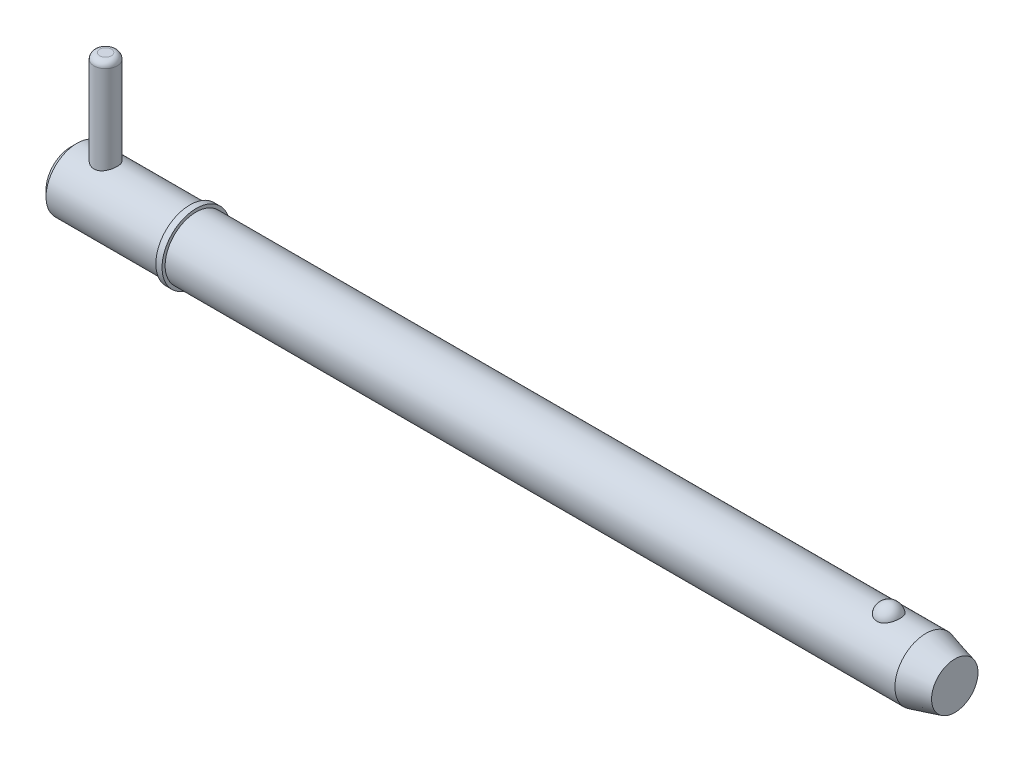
ISO-10303-21;
HEADER;
FILE_DESCRIPTION(('STEP AP214'),'2;1');
FILE_NAME('part.step','',(''),(''),'','','');
FILE_SCHEMA(('AUTOMOTIVE_DESIGN { 1 0 10303 214 1 1 1 1 }'));
ENDSEC;
DATA;
#1=APPLICATION_CONTEXT('core data for automotive mechanical design processes');
#2=APPLICATION_PROTOCOL_DEFINITION('international standard','automotive_design',2000,#1);
#3=PRODUCT_CONTEXT('',#1,'mechanical');
#4=PRODUCT('Part','Part','',(#3));
#5=PRODUCT_RELATED_PRODUCT_CATEGORY('part','',(#4));
#6=PRODUCT_DEFINITION_FORMATION('','',#4);
#7=PRODUCT_DEFINITION_CONTEXT('part definition',#1,'design');
#8=PRODUCT_DEFINITION('design','',#6,#7);
#9=PRODUCT_DEFINITION_SHAPE('','',#8);
#10=(LENGTH_UNIT() NAMED_UNIT(*) SI_UNIT(.MILLI.,.METRE.));
#11=(NAMED_UNIT(*) PLANE_ANGLE_UNIT() SI_UNIT($,.RADIAN.));
#12=(NAMED_UNIT(*) SI_UNIT($,.STERADIAN.) SOLID_ANGLE_UNIT());
#13=UNCERTAINTY_MEASURE_WITH_UNIT(LENGTH_MEASURE(1.E-05),#10,'distance_accuracy_value','');
#14=(GEOMETRIC_REPRESENTATION_CONTEXT(3) GLOBAL_UNCERTAINTY_ASSIGNED_CONTEXT((#13)) GLOBAL_UNIT_ASSIGNED_CONTEXT((#10,
#11,#12)) REPRESENTATION_CONTEXT('',''));
#15=CARTESIAN_POINT('',(0.,0.,0.));
#16=DIRECTION('',(0.,0.,1.));
#17=DIRECTION('',(1.,0.,0.));
#18=AXIS2_PLACEMENT_3D('',#15,#16,#17);
#19=CARTESIAN_POINT('',(7.14,25.4,0.));
#20=DIRECTION('',(0.,-1.,0.));
#21=DIRECTION('',(0.,0.,-1.));
#22=AXIS2_PLACEMENT_3D('',#19,#20,#21);
#23=CYLINDRICAL_SURFACE('',#22,2.38);
#24=CARTESIAN_POINT('',(7.14,-5.16,0.));
#25=DIRECTION('',(0.,1.,0.));
#26=DIRECTION('',(0.,0.,1.));
#27=AXIS2_PLACEMENT_3D('',#24,#25,#26);
#28=CIRCLE('',#27,2.38);
#29=CARTESIAN_POINT('',(7.14,-5.16,2.38));
#30=VERTEX_POINT('',#29);
#31=EDGE_CURVE('P0_E25',#30,#30,#28,.T.);
#32=ORIENTED_EDGE('',*,*,#31,.T.);
#33=EDGE_LOOP('',(#32));
#34=FACE_BOUND('',#33,.T.);
#35=CARTESIAN_POINT('',(7.14,24.21,0.));
#36=DIRECTION('',(0.,1.,0.));
#37=DIRECTION('',(0.,0.,1.));
#38=AXIS2_PLACEMENT_3D('',#35,#36,#37);
#39=CIRCLE('',#38,2.38);
#40=CARTESIAN_POINT('',(7.14,24.21,2.38));
#41=VERTEX_POINT('',#40);
#42=EDGE_CURVE('P0_E29',#41,#41,#39,.F.);
#43=ORIENTED_EDGE('',*,*,#42,.T.);
#44=EDGE_LOOP('',(#43));
#45=FACE_BOUND('',#44,.T.);
#46=ADVANCED_FACE('P0_F14',(#34,#45),#23,.T.);
#47=CARTESIAN_POINT('',(7.14,25.4,0.));
#48=DIRECTION('',(0.,1.,0.));
#49=DIRECTION('',(0.,0.,1.));
#50=AXIS2_PLACEMENT_3D('',#47,#48,#49);
#51=PLANE('',#50);
#52=CARTESIAN_POINT('',(7.14,25.4,0.));
#53=DIRECTION('',(0.,1.,0.));
#54=DIRECTION('',(0.,0.,1.));
#55=AXIS2_PLACEMENT_3D('',#52,#53,#54);
#56=CIRCLE('',#55,1.19);
#57=CARTESIAN_POINT('',(7.14,25.4,1.19));
#58=VERTEX_POINT('',#57);
#59=EDGE_CURVE('P0_E10',#58,#58,#56,.T.);
#60=ORIENTED_EDGE('',*,*,#59,.T.);
#61=EDGE_LOOP('',(#60));
#62=FACE_BOUND('',#61,.T.);
#63=ADVANCED_FACE('P0_F46',(#62),#51,.T.);
#64=CARTESIAN_POINT('',(7.14,-6.35,0.));
#65=DIRECTION('',(0.,1.,0.));
#66=DIRECTION('',(0.,0.,1.));
#67=AXIS2_PLACEMENT_3D('',#64,#65,#66);
#68=PLANE('',#67);
#69=CARTESIAN_POINT('',(7.14,-6.35,0.));
#70=DIRECTION('',(0.,1.,0.));
#71=DIRECTION('',(0.,0.,1.));
#72=AXIS2_PLACEMENT_3D('',#69,#70,#71);
#73=CIRCLE('',#72,1.19);
#74=CARTESIAN_POINT('',(7.14,-6.35,1.19));
#75=VERTEX_POINT('',#74);
#76=EDGE_CURVE('P0_E21',#75,#75,#73,.F.);
#77=ORIENTED_EDGE('',*,*,#76,.T.);
#78=EDGE_LOOP('',(#77));
#79=FACE_BOUND('',#78,.T.);
#80=ADVANCED_FACE('P0_F43',(#79),#68,.F.);
#81=CARTESIAN_POINT('',(7.14,-5.16,0.));
#82=DIRECTION('',(0.,1.,0.));
#83=DIRECTION('',(0.,0.,1.));
#84=AXIS2_PLACEMENT_3D('',#81,#82,#83);
#85=DEGENERATE_TOROIDAL_SURFACE('',#84,1.19,1.19,.T.);
#86=ORIENTED_EDGE('',*,*,#76,.F.);
#87=EDGE_LOOP('',(#86));
#88=FACE_BOUND('',#87,.T.);
#89=ORIENTED_EDGE('',*,*,#31,.F.);
#90=EDGE_LOOP('',(#89));
#91=FACE_BOUND('',#90,.T.);
#92=ADVANCED_FACE('P0_F38',(#88,#91),#85,.T.);
#93=CARTESIAN_POINT('',(7.14,24.21,0.));
#94=DIRECTION('',(0.,1.,0.));
#95=DIRECTION('',(0.,0.,1.));
#96=AXIS2_PLACEMENT_3D('',#93,#94,#95);
#97=DEGENERATE_TOROIDAL_SURFACE('',#96,1.19,1.19,.T.);
#98=ORIENTED_EDGE('',*,*,#42,.F.);
#99=EDGE_LOOP('',(#98));
#100=FACE_BOUND('',#99,.T.);
#101=ORIENTED_EDGE('',*,*,#59,.F.);
#102=EDGE_LOOP('',(#101));
#103=FACE_BOUND('',#102,.T.);
#104=ADVANCED_FACE('P0_F16',(#100,#103),#97,.T.);
#105=CLOSED_SHELL('',(#46,#63,#80,#92,#104));
#106=MANIFOLD_SOLID_BREP('P0_B1',#105);
#107=CARTESIAN_POINT('',(0.,0.,0.));
#108=DIRECTION('',(1.,0.,0.));
#109=DIRECTION('',(0.,0.,-1.));
#110=AXIS2_PLACEMENT_3D('',#107,#108,#109);
#111=CYLINDRICAL_SURFACE('',#110,6.35);
#112=CARTESIAN_POINT('',(175.355369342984,0.,0.));
#113=DIRECTION('',(1.,0.,0.));
#114=DIRECTION('',(0.,0.,-1.));
#115=AXIS2_PLACEMENT_3D('',#112,#113,#114);
#116=CIRCLE('',#115,6.35);
#117=CARTESIAN_POINT('',(175.355369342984,0.,-6.35));
#118=VERTEX_POINT('',#117);
#119=EDGE_CURVE('P1_E81',#118,#118,#116,.T.);
#120=ORIENTED_EDGE('',*,*,#119,.F.);
#121=EDGE_LOOP('',(#120));
#122=FACE_BOUND('',#121,.T.);
#123=CARTESIAN_POINT('',(25.7,0.,0.));
#124=DIRECTION('',(1.,0.,0.));
#125=DIRECTION('',(0.,0.,-1.));
#126=AXIS2_PLACEMENT_3D('',#123,#124,#125);
#127=CIRCLE('',#126,6.35);
#128=CARTESIAN_POINT('',(25.7,0.,-6.35));
#129=VERTEX_POINT('',#128);
#130=EDGE_CURVE('P1_E85',#129,#129,#127,.T.);
#131=ORIENTED_EDGE('',*,*,#130,.T.);
#132=EDGE_LOOP('',(#131));
#133=FACE_BOUND('',#132,.T.);
#134=CARTESIAN_POINT('',(167.730021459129,5.87502187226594,2.40969251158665));
#135=CARTESIAN_POINT('',(167.605030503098,5.87501645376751,2.40969773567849));
#136=CARTESIAN_POINT('',(167.480080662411,5.87916061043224,2.39967292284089));
#137=CARTESIAN_POINT('',(167.233909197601,5.89523112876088,2.35991730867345));
#138=CARTESIAN_POINT('',(167.112686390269,5.90715499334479,2.33019283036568));
#139=CARTESIAN_POINT('',(166.877517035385,5.93739567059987,2.25201402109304));
#140=CARTESIAN_POINT('',(166.763560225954,5.95570321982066,2.20358681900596));
#141=CARTESIAN_POINT('',(166.54557352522,5.99672067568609,2.08937987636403));
#142=CARTESIAN_POINT('',(166.441545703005,6.0194314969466,2.02359652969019));
#143=CARTESIAN_POINT('',(166.242943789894,6.06760647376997,1.87428969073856));
#144=CARTESIAN_POINT('',(166.148726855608,6.09313095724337,1.79031110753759));
#145=CARTESIAN_POINT('',(165.975255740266,6.14375873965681,1.6080017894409));
#146=CARTESIAN_POINT('',(165.896004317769,6.16886196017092,1.50966841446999));
#147=CARTESIAN_POINT('',(165.750845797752,6.21724600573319,1.29645884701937));
#148=CARTESIAN_POINT('',(165.685688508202,6.24039621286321,1.18104158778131));
#149=CARTESIAN_POINT('',(165.574703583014,6.28117277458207,0.940351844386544));
#150=CARTESIAN_POINT('',(165.528877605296,6.29879865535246,0.815078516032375));
#151=CARTESIAN_POINT('',(165.457023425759,6.32692073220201,0.556494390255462));
#152=CARTESIAN_POINT('',(165.431249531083,6.33732517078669,0.423102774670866));
#153=CARTESIAN_POINT('',(165.400988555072,6.34957673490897,0.153542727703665));
#154=CARTESIAN_POINT('',(165.396500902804,6.35142408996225,0.0173743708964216));
#155=CARTESIAN_POINT('',(165.408865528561,6.34638925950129,-0.253036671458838));
#156=CARTESIAN_POINT('',(165.425594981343,6.33955731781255,-0.387285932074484));
#157=CARTESIAN_POINT('',(165.479843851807,6.31794129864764,-0.650851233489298));
#158=CARTESIAN_POINT('',(165.517363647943,6.3031570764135,-0.780167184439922));
#159=CARTESIAN_POINT('',(165.612500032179,6.26711642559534,-1.03041949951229));
#160=CARTESIAN_POINT('',(165.670143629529,6.24585130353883,-1.15134433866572));
#161=CARTESIAN_POINT('',(165.804352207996,6.19905619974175,-1.38129800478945));
#162=CARTESIAN_POINT('',(165.880918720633,6.17352587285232,-1.49032586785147));
#163=CARTESIAN_POINT('',(166.051753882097,6.12080227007,-1.69393164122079));
#164=CARTESIAN_POINT('',(166.146100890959,6.09360200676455,-1.78844209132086));
#165=CARTESIAN_POINT('',(166.350119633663,6.04070434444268,-1.95970536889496));
#166=CARTESIAN_POINT('',(166.459790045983,6.015006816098,-2.0364597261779));
#167=CARTESIAN_POINT('',(166.689187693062,5.96867714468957,-2.16845644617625));
#168=CARTESIAN_POINT('',(166.808652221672,5.94794910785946,-2.22412062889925));
#169=CARTESIAN_POINT('',(167.056218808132,5.91340580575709,-2.31440992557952));
#170=CARTESIAN_POINT('',(167.184317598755,5.89958794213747,-2.34904294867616));
#171=CARTESIAN_POINT('',(167.438582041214,5.88111049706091,-2.39491590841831));
#172=CARTESIAN_POINT('',(167.564520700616,5.87602512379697,-2.40724512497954));
#173=CARTESIAN_POINT('',(167.816786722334,5.87428980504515,-2.41147867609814));
#174=CARTESIAN_POINT('',(167.943114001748,5.8776381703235,-2.40338710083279));
#175=CARTESIAN_POINT('',(168.188417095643,5.89212921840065,-2.36762715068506));
#176=CARTESIAN_POINT('',(168.307499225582,5.90302431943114,-2.3405803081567));
#177=CARTESIAN_POINT('',(168.53924472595,5.93113752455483,-2.26839066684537));
#178=CARTESIAN_POINT('',(168.651907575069,5.94835614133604,-2.22324640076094));
#179=CARTESIAN_POINT('',(168.870400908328,5.9877301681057,-2.11493806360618));
#180=CARTESIAN_POINT('',(168.976028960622,6.00998499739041,-2.05140269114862));
#181=CARTESIAN_POINT('',(169.175300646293,6.05690144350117,-1.90842705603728));
#182=CARTESIAN_POINT('',(169.268941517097,6.08156361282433,-1.82898313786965));
#183=CARTESIAN_POINT('',(169.446675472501,6.13211715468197,-1.65182429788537));
#184=CARTESIAN_POINT('',(169.530055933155,6.15800825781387,-1.5533938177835));
#185=CARTESIAN_POINT('',(169.679790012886,6.20712834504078,-1.34374214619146));
#186=CARTESIAN_POINT('',(169.746140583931,6.23035685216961,-1.23251867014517));
#187=CARTESIAN_POINT('',(169.862345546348,6.27251177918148,-0.996447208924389));
#188=CARTESIAN_POINT('',(169.911607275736,6.29127762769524,-0.871278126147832));
#189=CARTESIAN_POINT('',(169.989614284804,6.3215862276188,-0.613870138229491));
#190=CARTESIAN_POINT('',(170.018359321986,6.33312889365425,-0.481631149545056));
#191=CARTESIAN_POINT('',(170.05477058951,6.34782349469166,-0.213672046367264));
#192=CARTESIAN_POINT('',(170.062413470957,6.35096613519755,-0.0779482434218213));
#193=CARTESIAN_POINT('',(170.056395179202,6.34851322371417,0.192943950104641));
#194=CARTESIAN_POINT('',(170.042734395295,6.3429178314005,0.328112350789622));
#195=CARTESIAN_POINT('',(169.99450361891,6.32360512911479,0.593406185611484));
#196=CARTESIAN_POINT('',(169.960031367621,6.30992579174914,0.723552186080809));
#197=CARTESIAN_POINT('',(169.870953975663,6.27586325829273,0.97583417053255));
#198=CARTESIAN_POINT('',(169.81634761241,6.25547965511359,1.09796966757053));
#199=CARTESIAN_POINT('',(169.68775879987,6.20998183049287,1.33148921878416));
#200=CARTESIAN_POINT('',(169.613674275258,6.18484288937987,1.44281227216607));
#201=CARTESIAN_POINT('',(169.447820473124,6.13258735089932,1.65087683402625));
#202=CARTESIAN_POINT('',(169.356051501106,6.10547078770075,1.7476185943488));
#203=CARTESIAN_POINT('',(169.157183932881,6.05235879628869,1.92350926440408));
#204=CARTESIAN_POINT('',(169.050133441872,6.02636017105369,2.00271146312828));
#205=CARTESIAN_POINT('',(168.823138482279,5.97843747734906,2.14154159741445));
#206=CARTESIAN_POINT('',(168.703191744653,5.9565141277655,2.20116608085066));
#207=CARTESIAN_POINT('',(168.444523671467,5.91812106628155,2.30250570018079));
#208=CARTESIAN_POINT('',(168.30506980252,5.90217533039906,2.34256795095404));
#209=CARTESIAN_POINT('',(168.020397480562,5.88063128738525,2.3961521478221));
#210=CARTESIAN_POINT('',(167.87518174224,5.87502816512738,2.40968644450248));
#211=CARTESIAN_POINT('',(167.730021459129,5.87502187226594,2.40969251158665));
#212=B_SPLINE_CURVE_WITH_KNOTS('',3,(#134,#135,#136,#137,#138,#139,#140,#141,#142,#143,#144,
#145,#146,#147,#148,#149,#150,#151,#152,#153,#154,#155,#156,#157,#158,#159,#160,#161,#162,#163,
#164,#165,#166,#167,#168,#169,#170,#171,#172,#173,#174,#175,#176,#177,#178,#179,#180,#181,#182,
#183,#184,#185,#186,#187,#188,#189,#190,#191,#192,#193,#194,#195,#196,#197,#198,#199,#200,#201,
#202,#203,#204,#205,#206,#207,#208,#209,#210,#211),.UNSPECIFIED.,.T.,.F.,(4,2,2,2,2,2,2,2,2,2,2,
2,2,2,2,2,2,2,2,2,2,2,2,2,2,2,2,2,2,2,2,2,2,2,2,2,2,2,4),(0.,0.374440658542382,
0.748761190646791,1.122540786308,1.4963981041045,1.88098871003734,2.26565013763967,
2.66741104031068,3.06920639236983,3.47601794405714,3.88281858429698,4.28727498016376,
4.69173873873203,5.09674745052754,5.50178895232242,5.90865911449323,6.31549420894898,
6.71369855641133,7.11175305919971,7.48978077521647,7.86773278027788,8.23383886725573,
8.59997464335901,8.97409044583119,9.34829231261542,9.74122667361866,10.1342313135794,
10.5397522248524,10.9452779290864,11.3512521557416,11.75721896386,12.1612938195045,
12.5653932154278,12.9716540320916,13.3779078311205,13.7829098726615,14.1879832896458,
14.6230486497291,15.0579114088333),.UNSPECIFIED.);
#213=CARTESIAN_POINT('',(167.730021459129,5.87502187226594,2.40969251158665));
#214=VERTEX_POINT('',#213);
#215=EDGE_CURVE('P1_E35',#214,#214,#212,.T.);
#216=ORIENTED_EDGE('',*,*,#215,.T.);
#217=EDGE_LOOP('',(#216));
#218=FACE_BOUND('',#217,.T.);
#219=ADVANCED_FACE('P1_F13',(#122,#133,#218),#111,.T.);
#220=CARTESIAN_POINT('',(0.,0.,0.));
#221=DIRECTION('',(-1.,0.,0.));
#222=DIRECTION('',(0.,0.,1.));
#223=AXIS2_PLACEMENT_3D('',#220,#221,#222);
#224=PLANE('',#223);
#225=CARTESIAN_POINT('',(0.,0.,0.));
#226=DIRECTION('',(1.,0.,0.));
#227=DIRECTION('',(0.,0.,-1.));
#228=AXIS2_PLACEMENT_3D('',#225,#226,#227);
#229=CIRCLE('',#228,5.08);
#230=CARTESIAN_POINT('',(0.,0.,-5.08));
#231=VERTEX_POINT('',#230);
#232=EDGE_CURVE('P1_E9',#231,#231,#229,.T.);
#233=ORIENTED_EDGE('',*,*,#232,.F.);
#234=EDGE_LOOP('',(#233));
#235=FACE_BOUND('',#234,.T.);
#236=ADVANCED_FACE('P1_F15',(#235),#224,.T.);
#237=CARTESIAN_POINT('',(1.27,0.,0.));
#238=DIRECTION('',(1.,0.,0.));
#239=DIRECTION('',(0.,0.,-1.));
#240=AXIS2_PLACEMENT_3D('',#237,#238,#239);
#241=CONICAL_SURFACE('',#240,6.35,0.78539816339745);
#242=ORIENTED_EDGE('',*,*,#232,.T.);
#243=EDGE_LOOP('',(#242));
#244=FACE_BOUND('',#243,.T.);
#245=CARTESIAN_POINT('',(1.27,0.,0.));
#246=DIRECTION('',(1.,0.,0.));
#247=DIRECTION('',(0.,0.,-1.));
#248=AXIS2_PLACEMENT_3D('',#245,#246,#247);
#249=CIRCLE('',#248,6.35);
#250=CARTESIAN_POINT('',(1.27,0.,-6.35));
#251=VERTEX_POINT('',#250);
#252=EDGE_CURVE('P1_E26',#251,#251,#249,.T.);
#253=ORIENTED_EDGE('',*,*,#252,.F.);
#254=EDGE_LOOP('',(#253));
#255=FACE_BOUND('',#254,.T.);
#256=ADVANCED_FACE('P1_F77',(#244,#255),#241,.T.);
#257=CARTESIAN_POINT('',(0.,0.,0.));
#258=DIRECTION('',(1.,0.,0.));
#259=DIRECTION('',(0.,0.,-1.));
#260=AXIS2_PLACEMENT_3D('',#257,#258,#259);
#261=CYLINDRICAL_SURFACE('',#260,6.35);
#262=CARTESIAN_POINT('',(7.14,-5.88711304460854,2.38));
#263=CARTESIAN_POINT('',(7.01146258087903,-5.88710856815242,2.38000480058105));
#264=CARTESIAN_POINT('',(6.88295682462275,-5.89136840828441,2.36955244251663));
#265=CARTESIAN_POINT('',(6.62981934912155,-5.90782785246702,2.32820953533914));
#266=CARTESIAN_POINT('',(6.50518751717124,-5.92002722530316,2.29731958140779));
#267=CARTESIAN_POINT('',(6.26352403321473,-5.95079384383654,2.21639366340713));
#268=CARTESIAN_POINT('',(6.14647496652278,-5.96934583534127,2.16640353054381));
#269=CARTESIAN_POINT('',(5.92237941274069,-6.01070278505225,2.04885862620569));
#270=CARTESIAN_POINT('',(5.81533593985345,-6.03350901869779,1.98129858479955));
#271=CARTESIAN_POINT('',(5.60897525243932,-6.08207341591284,1.82693902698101));
#272=CARTESIAN_POINT('',(5.51022503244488,-6.10791836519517,1.73940861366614));
#273=CARTESIAN_POINT('',(5.32840561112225,-6.15892405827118,1.54914379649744));
#274=CARTESIAN_POINT('',(5.24533975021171,-6.1840846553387,1.44640616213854));
#275=CARTESIAN_POINT('',(5.09451639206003,-6.23191821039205,1.22434014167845));
#276=CARTESIAN_POINT('',(5.02737511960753,-6.25447755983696,1.10456656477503));
#277=CARTESIAN_POINT('',(4.91443001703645,-6.2935236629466,0.854429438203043));
#278=CARTESIAN_POINT('',(4.86861879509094,-6.31001251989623,0.724069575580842));
#279=CARTESIAN_POINT('',(4.80162253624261,-6.33444370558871,0.46242122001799));
#280=CARTESIAN_POINT('',(4.77946137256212,-6.34272370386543,0.331414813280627));
#281=CARTESIAN_POINT('',(4.75726677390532,-6.35101600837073,0.0672982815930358));
#282=CARTESIAN_POINT('',(4.75722615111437,-6.35103100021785,-0.0658111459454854));
#283=CARTESIAN_POINT('',(4.77870510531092,-6.3430064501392,-0.323358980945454));
#284=CARTESIAN_POINT('',(4.79915922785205,-6.33536494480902,-0.447900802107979));
#285=CARTESIAN_POINT('',(4.85925493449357,-6.31340794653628,-0.69163609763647));
#286=CARTESIAN_POINT('',(4.89889787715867,-6.29909198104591,-0.810829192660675));
#287=CARTESIAN_POINT('',(4.9967414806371,-6.26494471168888,-1.04254212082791));
#288=CARTESIAN_POINT('',(5.05520370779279,-6.24503620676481,-1.1549396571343));
#289=CARTESIAN_POINT('',(5.1887948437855,-6.20171869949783,-1.3686079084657));
#290=CARTESIAN_POINT('',(5.26392912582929,-6.17830856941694,-1.46987502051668));
#291=CARTESIAN_POINT('',(5.43386591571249,-6.12878580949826,-1.66468415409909));
#292=CARTESIAN_POINT('',(5.52956139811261,-6.10259519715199,-1.75742857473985));
#293=CARTESIAN_POINT('',(5.73530435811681,-6.05155777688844,-1.92585331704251));
#294=CARTESIAN_POINT('',(5.84535542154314,-6.02671130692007,-2.00152936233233));
#295=CARTESIAN_POINT('',(6.07982989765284,-5.98068420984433,-2.13519109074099));
#296=CARTESIAN_POINT('',(6.20451768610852,-5.95959698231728,-2.19274775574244));
#297=CARTESIAN_POINT('',(6.4628145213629,-5.92455622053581,-2.28574558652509));
#298=CARTESIAN_POINT('',(6.59641856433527,-5.91059872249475,-2.32119904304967));
#299=CARTESIAN_POINT('',(6.86087441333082,-5.8923327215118,-2.36717069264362));
#300=CARTESIAN_POINT('',(6.99147192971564,-5.8875347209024,-2.37895573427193));
#301=CARTESIAN_POINT('',(7.25283805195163,-5.88674545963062,-2.38091046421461));
#302=CARTESIAN_POINT('',(7.38360660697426,-5.89075200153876,-2.37108554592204));
#303=CARTESIAN_POINT('',(7.63510696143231,-5.90662331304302,-2.33124781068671));
#304=CARTESIAN_POINT('',(7.75602069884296,-5.91810660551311,-2.30221396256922));
#305=CARTESIAN_POINT('',(7.99120505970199,-5.94718527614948,-2.22601401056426));
#306=CARTESIAN_POINT('',(8.10547431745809,-5.96478190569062,-2.17884419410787));
#307=CARTESIAN_POINT('',(8.32888632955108,-6.00491533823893,-2.06572311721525));
#308=CARTESIAN_POINT('',(8.43767672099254,-6.02761250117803,-1.99913452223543));
#309=CARTESIAN_POINT('',(8.6429894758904,-6.07511988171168,-1.84974438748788));
#310=CARTESIAN_POINT('',(8.73950733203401,-6.09993087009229,-1.76693691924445));
#311=CARTESIAN_POINT('',(8.9238741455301,-6.1507686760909,-1.58125563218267));
#312=CARTESIAN_POINT('',(9.01078732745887,-6.17677301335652,-1.47744327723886));
#313=CARTESIAN_POINT('',(9.16607127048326,-6.22556172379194,-1.25606967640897));
#314=CARTESIAN_POINT('',(9.23444197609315,-6.24834608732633,-1.13850838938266));
#315=CARTESIAN_POINT('',(9.3502493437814,-6.28811144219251,-0.893050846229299));
#316=CARTESIAN_POINT('',(9.39775808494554,-6.30511236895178,-0.765192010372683));
#317=CARTESIAN_POINT('',(9.47032640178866,-6.33145833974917,-0.502514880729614));
#318=CARTESIAN_POINT('',(9.49539651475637,-6.34080697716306,-0.367699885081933));
#319=CARTESIAN_POINT('',(9.52124059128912,-6.35045496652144,-0.103396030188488));
#320=CARTESIAN_POINT('',(9.52334421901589,-6.35124952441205,0.025945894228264));
#321=CARTESIAN_POINT('',(9.50661518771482,-6.34499064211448,0.283061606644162));
#322=CARTESIAN_POINT('',(9.48778504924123,-6.33793814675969,0.410835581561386));
#323=CARTESIAN_POINT('',(9.43065630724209,-6.31700307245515,0.658028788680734));
#324=CARTESIAN_POINT('',(9.39284291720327,-6.30329098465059,0.7775756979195));
#325=CARTESIAN_POINT('',(9.29930406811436,-6.27046903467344,1.00863789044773));
#326=CARTESIAN_POINT('',(9.2435752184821,-6.25135815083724,1.12015164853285));
#327=CARTESIAN_POINT('',(9.11312349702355,-6.20865254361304,1.33711407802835));
#328=CARTESIAN_POINT('',(9.03770094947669,-6.18490316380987,1.44211105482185));
#329=CARTESIAN_POINT('',(8.87110640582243,-6.13583718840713,1.63836897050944));
#330=CARTESIAN_POINT('',(8.77992879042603,-6.11052003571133,1.72962498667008));
#331=CARTESIAN_POINT('',(8.57869799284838,-6.05953829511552,1.90076098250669));
#332=CARTESIAN_POINT('',(8.46790320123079,-6.03392573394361,1.97978778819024));
#333=CARTESIAN_POINT('',(8.23379693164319,-5.98676607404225,2.11813466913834));
#334=CARTESIAN_POINT('',(8.11048418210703,-5.9652193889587,2.17745273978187));
#335=CARTESIAN_POINT('',(7.84900037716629,-5.92818393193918,2.27641807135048));
#336=CARTESIAN_POINT('',(7.71041678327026,-5.91299857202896,2.31510015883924));
#337=CARTESIAN_POINT('',(7.42787316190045,-5.89246887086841,2.36688002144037));
#338=CARTESIAN_POINT('',(7.28391673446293,-5.88711805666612,2.37999462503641));
#339=CARTESIAN_POINT('',(7.14,-5.88711304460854,2.38));
#340=B_SPLINE_CURVE_WITH_KNOTS('',3,(#262,#263,#264,#265,#266,#267,#268,#269,#270,#271,#272,
#273,#274,#275,#276,#277,#278,#279,#280,#281,#282,#283,#284,#285,#286,#287,#288,#289,#290,#291,
#292,#293,#294,#295,#296,#297,#298,#299,#300,#301,#302,#303,#304,#305,#306,#307,#308,#309,#310,
#311,#312,#313,#314,#315,#316,#317,#318,#319,#320,#321,#322,#323,#324,#325,#326,#327,#328,#329,
#330,#331,#332,#333,#334,#335,#336,#337,#338,#339),.UNSPECIFIED.,.T.,.F.,(4,2,2,2,2,2,2,2,2,2,2,
2,2,2,2,2,2,2,2,2,2,2,2,2,2,2,2,2,2,2,2,2,2,2,2,2,2,2,4),(0.,0.385076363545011,
0.770141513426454,1.15428843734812,1.53855071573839,1.94016118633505,2.3418570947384,
2.75720522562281,3.1724093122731,3.569721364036,3.96690431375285,4.34445758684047,
4.72203759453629,5.10511017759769,5.48830640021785,5.89390240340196,6.29959991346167,
6.71428455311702,7.12873839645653,7.52034494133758,7.91185376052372,8.28480528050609,
8.65783318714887,9.0448340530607,9.43197664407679,9.84363087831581,10.2552863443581,
10.6655081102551,11.0755371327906,11.4616919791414,11.847800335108,12.224507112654,
12.6012852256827,12.9938941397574,13.386643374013,13.8000944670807,14.2135876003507,
14.6450218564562,15.0761720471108),.UNSPECIFIED.);
#341=CARTESIAN_POINT('',(7.14,-5.88711304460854,2.38));
#342=VERTEX_POINT('',#341);
#343=EDGE_CURVE('P1_E17',#342,#342,#340,.T.);
#344=ORIENTED_EDGE('',*,*,#343,.F.);
#345=EDGE_LOOP('',(#344));
#346=FACE_BOUND('',#345,.T.);
#347=CARTESIAN_POINT('',(7.14,5.88711304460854,2.38));
#348=CARTESIAN_POINT('',(7.26853741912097,5.88710856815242,2.38000480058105));
#349=CARTESIAN_POINT('',(7.39704317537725,5.89136840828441,2.36955244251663));
#350=CARTESIAN_POINT('',(7.65018065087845,5.90782785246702,2.32820953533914));
#351=CARTESIAN_POINT('',(7.77481248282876,5.92002722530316,2.29731958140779));
#352=CARTESIAN_POINT('',(8.01647596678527,5.95079384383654,2.21639366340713));
#353=CARTESIAN_POINT('',(8.13352503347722,5.96934583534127,2.16640353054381));
#354=CARTESIAN_POINT('',(8.35762058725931,6.01070278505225,2.04885862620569));
#355=CARTESIAN_POINT('',(8.46466406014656,6.03350901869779,1.98129858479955));
#356=CARTESIAN_POINT('',(8.67102474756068,6.08207341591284,1.82693902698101));
#357=CARTESIAN_POINT('',(8.76977496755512,6.10791836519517,1.73940861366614));
#358=CARTESIAN_POINT('',(8.95159438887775,6.15892405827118,1.54914379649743));
#359=CARTESIAN_POINT('',(9.03466024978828,6.1840846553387,1.44640616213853));
#360=CARTESIAN_POINT('',(9.18548360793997,6.23191821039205,1.22434014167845));
#361=CARTESIAN_POINT('',(9.25262488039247,6.25447755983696,1.10456656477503));
#362=CARTESIAN_POINT('',(9.36556998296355,6.2935236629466,0.854429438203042));
#363=CARTESIAN_POINT('',(9.41138120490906,6.31001251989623,0.72406957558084));
#364=CARTESIAN_POINT('',(9.47837746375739,6.33444370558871,0.462421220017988));
#365=CARTESIAN_POINT('',(9.50053862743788,6.34272370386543,0.331414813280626));
#366=CARTESIAN_POINT('',(9.52273322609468,6.35101600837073,0.0672982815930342));
#367=CARTESIAN_POINT('',(9.52277384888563,6.35103100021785,-0.0658111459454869));
#368=CARTESIAN_POINT('',(9.50129489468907,6.3430064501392,-0.323358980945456));
#369=CARTESIAN_POINT('',(9.48084077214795,6.33536494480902,-0.447900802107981));
#370=CARTESIAN_POINT('',(9.42074506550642,6.31340794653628,-0.691636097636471));
#371=CARTESIAN_POINT('',(9.38110212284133,6.29909198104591,-0.810829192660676));
#372=CARTESIAN_POINT('',(9.2832585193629,6.26494471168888,-1.04254212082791));
#373=CARTESIAN_POINT('',(9.22479629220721,6.24503620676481,-1.1549396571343));
#374=CARTESIAN_POINT('',(9.0912051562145,6.20171869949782,-1.3686079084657));
#375=CARTESIAN_POINT('',(9.0160708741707,6.17830856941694,-1.46987502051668));
#376=CARTESIAN_POINT('',(8.84613408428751,6.12878580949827,-1.66468415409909));
#377=CARTESIAN_POINT('',(8.75043860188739,6.10259519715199,-1.75742857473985));
#378=CARTESIAN_POINT('',(8.54469564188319,6.05155777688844,-1.92585331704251));
#379=CARTESIAN_POINT('',(8.43464457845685,6.02671130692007,-2.00152936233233));
#380=CARTESIAN_POINT('',(8.20017010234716,5.98068420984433,-2.13519109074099));
#381=CARTESIAN_POINT('',(8.07548231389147,5.95959698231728,-2.19274775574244));
#382=CARTESIAN_POINT('',(7.8171854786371,5.9245562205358,-2.28574558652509));
#383=CARTESIAN_POINT('',(7.68358143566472,5.91059872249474,-2.32119904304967));
#384=CARTESIAN_POINT('',(7.41912558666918,5.8923327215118,-2.36717069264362));
#385=CARTESIAN_POINT('',(7.28852807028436,5.8875347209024,-2.37895573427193));
#386=CARTESIAN_POINT('',(7.02716194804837,5.88674545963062,-2.38091046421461));
#387=CARTESIAN_POINT('',(6.89639339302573,5.89075200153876,-2.37108554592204));
#388=CARTESIAN_POINT('',(6.64489303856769,5.90662331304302,-2.33124781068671));
#389=CARTESIAN_POINT('',(6.52397930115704,5.91810660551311,-2.30221396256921));
#390=CARTESIAN_POINT('',(6.288794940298,5.94718527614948,-2.22601401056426));
#391=CARTESIAN_POINT('',(6.17452568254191,5.96478190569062,-2.17884419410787));
#392=CARTESIAN_POINT('',(5.95111367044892,6.00491533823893,-2.06572311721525));
#393=CARTESIAN_POINT('',(5.84232327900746,6.02761250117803,-1.99913452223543));
#394=CARTESIAN_POINT('',(5.6370105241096,6.07511988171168,-1.84974438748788));
#395=CARTESIAN_POINT('',(5.54049266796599,6.09993087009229,-1.76693691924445));
#396=CARTESIAN_POINT('',(5.3561258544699,6.1507686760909,-1.58125563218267));
#397=CARTESIAN_POINT('',(5.26921267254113,6.17677301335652,-1.47744327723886));
#398=CARTESIAN_POINT('',(5.11392872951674,6.22556172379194,-1.25606967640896));
#399=CARTESIAN_POINT('',(5.04555802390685,6.24834608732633,-1.13850838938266));
#400=CARTESIAN_POINT('',(4.9297506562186,6.28811144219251,-0.893050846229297));
#401=CARTESIAN_POINT('',(4.88224191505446,6.30511236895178,-0.76519201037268));
#402=CARTESIAN_POINT('',(4.80967359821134,6.33145833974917,-0.502514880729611));
#403=CARTESIAN_POINT('',(4.78460348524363,6.34080697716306,-0.36769988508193));
#404=CARTESIAN_POINT('',(4.75875940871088,6.35045496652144,-0.103396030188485));
#405=CARTESIAN_POINT('',(4.75665578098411,6.35124952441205,0.025945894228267));
#406=CARTESIAN_POINT('',(4.77338481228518,6.34499064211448,0.283061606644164));
#407=CARTESIAN_POINT('',(4.79221495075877,6.33793814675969,0.410835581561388));
#408=CARTESIAN_POINT('',(4.84934369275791,6.31700307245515,0.658028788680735));
#409=CARTESIAN_POINT('',(4.88715708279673,6.30329098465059,0.777575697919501));
#410=CARTESIAN_POINT('',(4.98069593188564,6.27046903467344,1.00863789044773));
#411=CARTESIAN_POINT('',(5.0364247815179,6.25135815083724,1.12015164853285));
#412=CARTESIAN_POINT('',(5.16687650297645,6.20865254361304,1.33711407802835));
#413=CARTESIAN_POINT('',(5.24229905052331,6.18490316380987,1.44211105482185));
#414=CARTESIAN_POINT('',(5.40889359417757,6.13583718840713,1.63836897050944));
#415=CARTESIAN_POINT('',(5.50007120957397,6.11052003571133,1.72962498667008));
#416=CARTESIAN_POINT('',(5.70130200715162,6.05953829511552,1.90076098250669));
#417=CARTESIAN_POINT('',(5.81209679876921,6.03392573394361,1.97978778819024));
#418=CARTESIAN_POINT('',(6.04620306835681,5.98676607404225,2.11813466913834));
#419=CARTESIAN_POINT('',(6.16951581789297,5.9652193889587,2.17745273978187));
#420=CARTESIAN_POINT('',(6.43099962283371,5.92818393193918,2.27641807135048));
#421=CARTESIAN_POINT('',(6.56958321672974,5.91299857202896,2.31510015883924));
#422=CARTESIAN_POINT('',(6.85212683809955,5.89246887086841,2.36688002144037));
#423=CARTESIAN_POINT('',(6.99608326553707,5.88711805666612,2.37999462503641));
#424=CARTESIAN_POINT('',(7.14,5.88711304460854,2.38));
#425=B_SPLINE_CURVE_WITH_KNOTS('',3,(#347,#348,#349,#350,#351,#352,#353,#354,#355,#356,#357,
#358,#359,#360,#361,#362,#363,#364,#365,#366,#367,#368,#369,#370,#371,#372,#373,#374,#375,#376,
#377,#378,#379,#380,#381,#382,#383,#384,#385,#386,#387,#388,#389,#390,#391,#392,#393,#394,#395,
#396,#397,#398,#399,#400,#401,#402,#403,#404,#405,#406,#407,#408,#409,#410,#411,#412,#413,#414,
#415,#416,#417,#418,#419,#420,#421,#422,#423,#424),.UNSPECIFIED.,.T.,.F.,(4,2,2,2,2,2,2,2,2,2,2,
2,2,2,2,2,2,2,2,2,2,2,2,2,2,2,2,2,2,2,2,2,2,2,2,2,2,2,4),(0.,0.385076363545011,
0.770141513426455,1.15428843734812,1.53855071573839,1.94016118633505,2.3418570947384,
2.75720522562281,3.1724093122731,3.56972136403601,3.96690431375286,4.34445758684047,
4.72203759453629,5.10511017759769,5.48830640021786,5.89390240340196,6.29959991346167,
6.71428455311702,7.12873839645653,7.52034494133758,7.91185376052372,8.2848052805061,
8.65783318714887,9.0448340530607,9.43197664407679,9.84363087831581,10.2552863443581,
10.6655081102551,11.0755371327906,11.4616919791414,11.847800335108,12.2245071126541,
12.6012852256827,12.9938941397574,13.386643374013,13.8000944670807,14.2135876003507,
14.6450218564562,15.0761720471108),.UNSPECIFIED.);
#426=CARTESIAN_POINT('',(7.14,5.88711304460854,2.38));
#427=VERTEX_POINT('',#426);
#428=EDGE_CURVE('P1_E43',#427,#427,#425,.T.);
#429=ORIENTED_EDGE('',*,*,#428,.F.);
#430=EDGE_LOOP('',(#429));
#431=FACE_BOUND('',#430,.T.);
#432=ORIENTED_EDGE('',*,*,#252,.T.);
#433=EDGE_LOOP('',(#432));
#434=FACE_BOUND('',#433,.T.);
#435=CARTESIAN_POINT('',(24.43,0.,0.));
#436=DIRECTION('',(1.,0.,0.));
#437=DIRECTION('',(0.,0.,-1.));
#438=AXIS2_PLACEMENT_3D('',#435,#436,#437);
#439=CIRCLE('',#438,6.35);
#440=CARTESIAN_POINT('',(24.43,0.,-6.35));
#441=VERTEX_POINT('',#440);
#442=EDGE_CURVE('P1_E31',#441,#441,#439,.T.);
#443=ORIENTED_EDGE('',*,*,#442,.F.);
#444=EDGE_LOOP('',(#443));
#445=FACE_BOUND('',#444,.T.);
#446=ADVANCED_FACE('P1_F103',(#346,#431,#434,#445),#261,.T.);
#447=CARTESIAN_POINT('',(24.43,6.35,0.));
#448=DIRECTION('',(-1.,0.,0.));
#449=DIRECTION('',(0.,0.,1.));
#450=AXIS2_PLACEMENT_3D('',#447,#448,#449);
#451=PLANE('',#450);
#452=ORIENTED_EDGE('',*,*,#442,.T.);
#453=EDGE_LOOP('',(#452));
#454=FACE_BOUND('',#453,.T.);
#455=CARTESIAN_POINT('',(24.43,0.,0.));
#456=DIRECTION('',(1.,0.,0.));
#457=DIRECTION('',(0.,0.,-1.));
#458=AXIS2_PLACEMENT_3D('',#455,#456,#457);
#459=CIRCLE('',#458,6.985);
#460=CARTESIAN_POINT('',(24.43,0.,-6.985));
#461=VERTEX_POINT('',#460);
#462=EDGE_CURVE('P1_E91',#461,#461,#459,.T.);
#463=ORIENTED_EDGE('',*,*,#462,.F.);
#464=EDGE_LOOP('',(#463));
#465=FACE_BOUND('',#464,.T.);
#466=ADVANCED_FACE('P1_F100',(#454,#465),#451,.T.);
#467=CARTESIAN_POINT('',(0.,0.,0.));
#468=DIRECTION('',(1.,0.,0.));
#469=DIRECTION('',(0.,0.,-1.));
#470=AXIS2_PLACEMENT_3D('',#467,#468,#469);
#471=CYLINDRICAL_SURFACE('',#470,6.985);
#472=ORIENTED_EDGE('',*,*,#462,.T.);
#473=EDGE_LOOP('',(#472));
#474=FACE_BOUND('',#473,.T.);
#475=CARTESIAN_POINT('',(25.7,0.,0.));
#476=DIRECTION('',(1.,0.,0.));
#477=DIRECTION('',(0.,0.,-1.));
#478=AXIS2_PLACEMENT_3D('',#475,#476,#477);
#479=CIRCLE('',#478,6.985);
#480=CARTESIAN_POINT('',(25.7,0.,-6.985));
#481=VERTEX_POINT('',#480);
#482=EDGE_CURVE('P1_E88',#481,#481,#479,.T.);
#483=ORIENTED_EDGE('',*,*,#482,.F.);
#484=EDGE_LOOP('',(#483));
#485=FACE_BOUND('',#484,.T.);
#486=ADVANCED_FACE('P1_F68',(#474,#485),#471,.T.);
#487=CARTESIAN_POINT('',(25.7,6.985,0.));
#488=DIRECTION('',(1.,0.,0.));
#489=DIRECTION('',(0.,0.,-1.));
#490=AXIS2_PLACEMENT_3D('',#487,#488,#489);
#491=PLANE('',#490);
#492=ORIENTED_EDGE('',*,*,#482,.T.);
#493=EDGE_LOOP('',(#492));
#494=FACE_BOUND('',#493,.T.);
#495=ORIENTED_EDGE('',*,*,#130,.F.);
#496=EDGE_LOOP('',(#495));
#497=FACE_BOUND('',#496,.T.);
#498=ADVANCED_FACE('P1_F62',(#494,#497),#491,.T.);
#499=CARTESIAN_POINT('',(181.28,0.,0.));
#500=DIRECTION('',(-1.,0.,0.));
#501=DIRECTION('',(0.,0.,1.));
#502=AXIS2_PLACEMENT_3D('',#499,#500,#501);
#503=CONICAL_SURFACE('',#502,4.76250000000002,0.261799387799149);
#504=ORIENTED_EDGE('',*,*,#119,.T.);
#505=EDGE_LOOP('',(#504));
#506=FACE_BOUND('',#505,.T.);
#507=CARTESIAN_POINT('',(181.28,0.,0.));
#508=DIRECTION('',(1.,0.,0.));
#509=DIRECTION('',(0.,0.,-1.));
#510=AXIS2_PLACEMENT_3D('',#507,#508,#509);
#511=CIRCLE('',#510,4.76250000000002);
#512=CARTESIAN_POINT('',(181.28,0.,-4.76250000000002));
#513=VERTEX_POINT('',#512);
#514=EDGE_CURVE('P1_E42',#513,#513,#511,.T.);
#515=ORIENTED_EDGE('',*,*,#514,.F.);
#516=EDGE_LOOP('',(#515));
#517=FACE_BOUND('',#516,.T.);
#518=ADVANCED_FACE('P1_F59',(#506,#517),#503,.T.);
#519=CARTESIAN_POINT('',(181.28,4.76250000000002,0.));
#520=DIRECTION('',(1.,0.,0.));
#521=DIRECTION('',(0.,0.,-1.));
#522=AXIS2_PLACEMENT_3D('',#519,#520,#521);
#523=PLANE('',#522);
#524=ORIENTED_EDGE('',*,*,#514,.T.);
#525=EDGE_LOOP('',(#524));
#526=FACE_BOUND('',#525,.T.);
#527=ADVANCED_FACE('P1_F55',(#526),#523,.T.);
#528=CARTESIAN_POINT('',(167.730021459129,5.715,0.));
#529=DIRECTION('',(-1.,0.,0.));
#530=DIRECTION('',(0.,1.,0.));
#531=AXIS2_PLACEMENT_3D('',#528,#529,#530);
#532=SPHERICAL_SURFACE('',#531,2.41500000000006);
#533=ORIENTED_EDGE('',*,*,#215,.F.);
#534=EDGE_LOOP('',(#533));
#535=FACE_BOUND('',#534,.T.);
#536=ADVANCED_FACE('P1_F50',(#535),#532,.T.);
#537=CARTESIAN_POINT('',(7.14,-6.985,0.));
#538=DIRECTION('',(0.,1.,0.));
#539=DIRECTION('',(0.,0.,1.));
#540=AXIS2_PLACEMENT_3D('',#537,#538,#539);
#541=CYLINDRICAL_SURFACE('',#540,2.38);
#542=ORIENTED_EDGE('',*,*,#343,.T.);
#543=EDGE_LOOP('',(#542));
#544=FACE_BOUND('',#543,.T.);
#545=ORIENTED_EDGE('',*,*,#428,.T.);
#546=EDGE_LOOP('',(#545));
#547=FACE_BOUND('',#546,.T.);
#548=ADVANCED_FACE('P1_F54',(#544,#547),#541,.F.);
#549=CLOSED_SHELL('',(#219,#236,#256,#446,#466,#486,#498,#518,#527,#536,#548));
#550=MANIFOLD_SOLID_BREP('P1_B1',#549);
#551=ADVANCED_BREP_SHAPE_REPRESENTATION('',(#18,#106,#550),#14);
#552=SHAPE_DEFINITION_REPRESENTATION(#9,#551);
ENDSEC;
END-ISO-10303-21;
